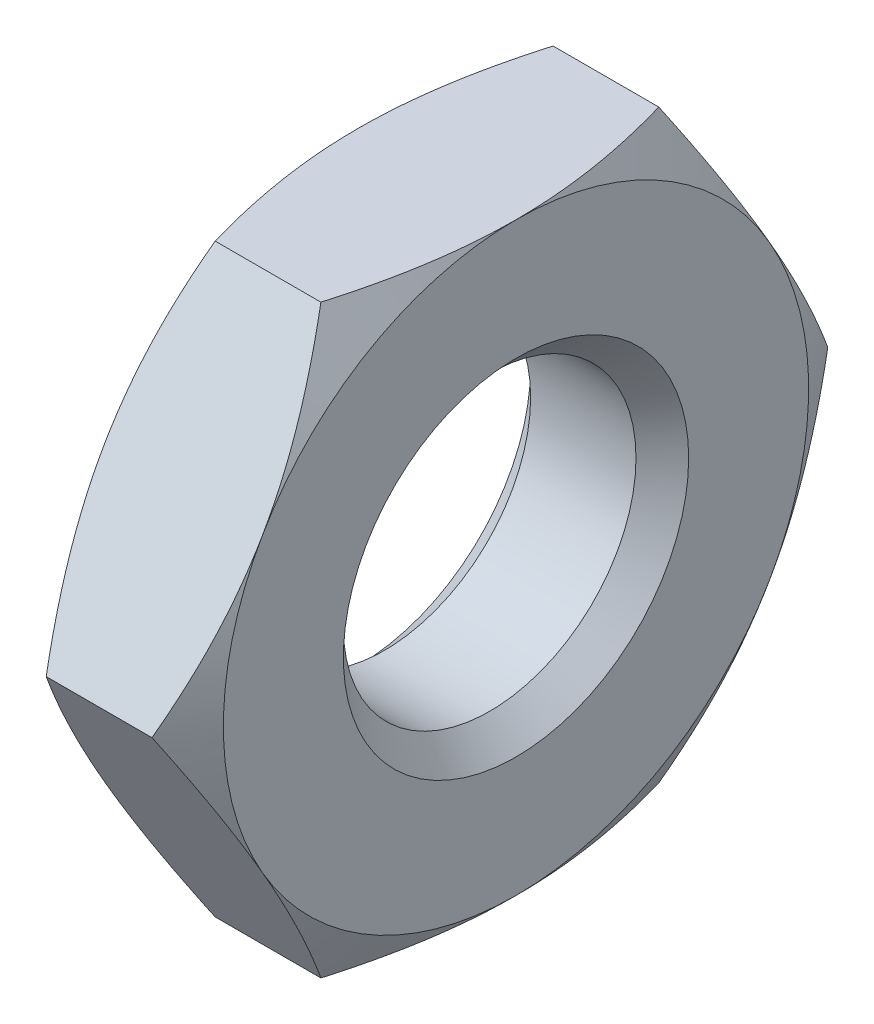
ISO-10303-21;
HEADER;
FILE_DESCRIPTION(('STEP AP214'),'2;1');
FILE_NAME('part.step','',(''),(''),'','','');
FILE_SCHEMA(('AUTOMOTIVE_DESIGN { 1 0 10303 214 1 1 1 1 }'));
ENDSEC;
DATA;
#1=APPLICATION_CONTEXT('core data for automotive mechanical design processes');
#2=APPLICATION_PROTOCOL_DEFINITION('international standard','automotive_design',2000,#1);
#3=PRODUCT_CONTEXT('',#1,'mechanical');
#4=PRODUCT('Part','Part','',(#3));
#5=PRODUCT_RELATED_PRODUCT_CATEGORY('part','',(#4));
#6=PRODUCT_DEFINITION_FORMATION('','',#4);
#7=PRODUCT_DEFINITION_CONTEXT('part definition',#1,'design');
#8=PRODUCT_DEFINITION('design','',#6,#7);
#9=PRODUCT_DEFINITION_SHAPE('','',#8);
#10=(LENGTH_UNIT() NAMED_UNIT(*) SI_UNIT(.MILLI.,.METRE.));
#11=(NAMED_UNIT(*) PLANE_ANGLE_UNIT() SI_UNIT($,.RADIAN.));
#12=(NAMED_UNIT(*) SI_UNIT($,.STERADIAN.) SOLID_ANGLE_UNIT());
#13=UNCERTAINTY_MEASURE_WITH_UNIT(LENGTH_MEASURE(1.E-05),#10,'distance_accuracy_value','');
#14=(GEOMETRIC_REPRESENTATION_CONTEXT(3) GLOBAL_UNCERTAINTY_ASSIGNED_CONTEXT((#13)) GLOBAL_UNIT_ASSIGNED_CONTEXT((#10,
#11,#12)) REPRESENTATION_CONTEXT('',''));
#15=CARTESIAN_POINT('',(0.,0.,0.));
#16=DIRECTION('',(0.,0.,1.));
#17=DIRECTION('',(1.,0.,0.));
#18=AXIS2_PLACEMENT_3D('',#15,#16,#17);
#19=CARTESIAN_POINT('',(1.35,2.5,-1.44337567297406));
#20=DIRECTION('',(1.,0.,0.));
#21=DIRECTION('',(0.,0.,-1.));
#22=AXIS2_PLACEMENT_3D('',#19,#20,#21);
#23=PLANE('',#22);
#24=CARTESIAN_POINT('',(1.35,0.,0.));
#25=DIRECTION('',(1.,0.,0.));
#26=DIRECTION('',(0.,0.,-1.));
#27=AXIS2_PLACEMENT_3D('',#24,#25,#26);
#28=CIRCLE('',#27,1.47500000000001);
#29=CARTESIAN_POINT('',(1.35,0.,-1.47500000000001));
#30=VERTEX_POINT('',#29);
#31=EDGE_CURVE('E11',#30,#30,#28,.F.);
#32=ORIENTED_EDGE('',*,*,#31,.T.);
#33=EDGE_LOOP('',(#32));
#34=FACE_BOUND('',#33,.T.);
#35=CARTESIAN_POINT('',(1.35,0.,0.));
#36=DIRECTION('',(1.,0.,0.));
#37=DIRECTION('',(0.,0.,-1.));
#38=AXIS2_PLACEMENT_3D('',#35,#36,#37);
#39=CIRCLE('',#38,2.5);
#40=CARTESIAN_POINT('',(1.35,-2.5,0.));
#41=VERTEX_POINT('',#40);
#42=CARTESIAN_POINT('',(1.35,-1.25,-2.1650635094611));
#43=VERTEX_POINT('',#42);
#44=EDGE_CURVE('E142',#41,#43,#39,.T.);
#45=ORIENTED_EDGE('',*,*,#44,.T.);
#46=CARTESIAN_POINT('',(1.35,1.25,-2.1650635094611));
#47=VERTEX_POINT('',#46);
#48=EDGE_CURVE('E130',#43,#47,#39,.T.);
#49=ORIENTED_EDGE('',*,*,#48,.T.);
#50=CARTESIAN_POINT('',(1.35,2.5,0.));
#51=VERTEX_POINT('',#50);
#52=EDGE_CURVE('E144',#47,#51,#39,.T.);
#53=ORIENTED_EDGE('',*,*,#52,.T.);
#54=CARTESIAN_POINT('',(1.35,1.25,2.1650635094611));
#55=VERTEX_POINT('',#54);
#56=EDGE_CURVE('E55',#51,#55,#39,.T.);
#57=ORIENTED_EDGE('',*,*,#56,.T.);
#58=CARTESIAN_POINT('',(1.35,-1.25,2.1650635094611));
#59=VERTEX_POINT('',#58);
#60=EDGE_CURVE('E63',#55,#59,#39,.T.);
#61=ORIENTED_EDGE('',*,*,#60,.T.);
#62=EDGE_CURVE('E166',#59,#41,#39,.T.);
#63=ORIENTED_EDGE('',*,*,#62,.T.);
#64=EDGE_LOOP('',(#45,#49,#53,#57,#61,#63));
#65=FACE_BOUND('',#64,.T.);
#66=ADVANCED_FACE('F39',(#34,#65),#23,.T.);
#67=CARTESIAN_POINT('',(0.,2.5,-1.44337567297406));
#68=DIRECTION('',(1.,0.,0.));
#69=DIRECTION('',(0.,0.,-1.));
#70=AXIS2_PLACEMENT_3D('',#67,#68,#69);
#71=PLANE('',#70);
#72=CARTESIAN_POINT('',(0.,0.,0.));
#73=DIRECTION('',(1.,0.,0.));
#74=DIRECTION('',(0.,0.,-1.));
#75=AXIS2_PLACEMENT_3D('',#72,#73,#74);
#76=CIRCLE('',#75,1.475);
#77=CARTESIAN_POINT('',(0.,0.,-1.475));
#78=VERTEX_POINT('',#77);
#79=EDGE_CURVE('E164',#78,#78,#76,.T.);
#80=ORIENTED_EDGE('',*,*,#79,.T.);
#81=EDGE_LOOP('',(#80));
#82=FACE_BOUND('',#81,.T.);
#83=CARTESIAN_POINT('',(0.,0.,0.));
#84=DIRECTION('',(1.,0.,0.));
#85=DIRECTION('',(0.,0.,-1.));
#86=AXIS2_PLACEMENT_3D('',#83,#84,#85);
#87=CIRCLE('',#86,2.5);
#88=CARTESIAN_POINT('',(0.,-1.25,-2.1650635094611));
#89=VERTEX_POINT('',#88);
#90=CARTESIAN_POINT('',(0.,1.25,-2.1650635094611));
#91=VERTEX_POINT('',#90);
#92=EDGE_CURVE('E173',#89,#91,#87,.T.);
#93=ORIENTED_EDGE('',*,*,#92,.F.);
#94=CARTESIAN_POINT('',(0.,-2.5,0.));
#95=VERTEX_POINT('',#94);
#96=EDGE_CURVE('E318',#95,#89,#87,.T.);
#97=ORIENTED_EDGE('',*,*,#96,.F.);
#98=CARTESIAN_POINT('',(0.,-1.25,2.1650635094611));
#99=VERTEX_POINT('',#98);
#100=EDGE_CURVE('E321',#99,#95,#87,.T.);
#101=ORIENTED_EDGE('',*,*,#100,.F.);
#102=CARTESIAN_POINT('',(0.,1.25,2.1650635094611));
#103=VERTEX_POINT('',#102);
#104=EDGE_CURVE('E327',#103,#99,#87,.T.);
#105=ORIENTED_EDGE('',*,*,#104,.F.);
#106=CARTESIAN_POINT('',(0.,2.5,0.));
#107=VERTEX_POINT('',#106);
#108=EDGE_CURVE('E178',#107,#103,#87,.T.);
#109=ORIENTED_EDGE('',*,*,#108,.F.);
#110=EDGE_CURVE('E174',#91,#107,#87,.T.);
#111=ORIENTED_EDGE('',*,*,#110,.F.);
#112=EDGE_LOOP('',(#93,#97,#101,#105,#109,#111));
#113=FACE_BOUND('',#112,.T.);
#114=ADVANCED_FACE('F319',(#82,#113),#71,.F.);
#115=CARTESIAN_POINT('',(1.35,0.,0.));
#116=DIRECTION('',(-1.,0.,0.));
#117=DIRECTION('',(0.,0.,1.));
#118=AXIS2_PLACEMENT_3D('',#115,#116,#117);
#119=CYLINDRICAL_SURFACE('',#118,1.25);
#120=CARTESIAN_POINT('',(0.224999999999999,0.,0.));
#121=DIRECTION('',(1.,0.,0.));
#122=DIRECTION('',(0.,0.,-1.));
#123=AXIS2_PLACEMENT_3D('',#120,#121,#122);
#124=CIRCLE('',#123,1.25);
#125=CARTESIAN_POINT('',(0.224999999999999,0.,1.25));
#126=VERTEX_POINT('',#125);
#127=EDGE_CURVE('E48',#126,#126,#124,.F.);
#128=CARTESIAN_POINT('',(1.125,0.,0.));
#129=DIRECTION('',(1.,0.,0.));
#130=DIRECTION('',(0.,0.,-1.));
#131=AXIS2_PLACEMENT_3D('',#128,#129,#130);
#132=CIRCLE('',#131,1.25);
#133=CARTESIAN_POINT('',(1.125,0.,1.25));
#134=VERTEX_POINT('',#133);
#135=EDGE_CURVE('E387',#134,#134,#132,.T.);
#136=CARTESIAN_POINT('',(0.224999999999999,0.,1.25));
#137=CARTESIAN_POINT('',(0.234374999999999,0.,1.25));
#138=CARTESIAN_POINT('',(0.243749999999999,0.,1.25));
#139=CARTESIAN_POINT('',(0.262499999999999,0.,1.25));
#140=CARTESIAN_POINT('',(0.271874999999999,0.,1.25));
#141=CARTESIAN_POINT('',(0.290624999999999,0.,1.25));
#142=CARTESIAN_POINT('',(0.299999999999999,0.,1.25));
#143=CARTESIAN_POINT('',(0.318749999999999,0.,1.25));
#144=CARTESIAN_POINT('',(0.328124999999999,0.,1.25));
#145=CARTESIAN_POINT('',(0.346874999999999,0.,1.25));
#146=CARTESIAN_POINT('',(0.356249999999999,0.,1.25));
#147=CARTESIAN_POINT('',(0.374999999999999,0.,1.25));
#148=CARTESIAN_POINT('',(0.384374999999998,0.,1.25));
#149=CARTESIAN_POINT('',(0.403124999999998,0.,1.25));
#150=CARTESIAN_POINT('',(0.412499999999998,0.,1.25));
#151=CARTESIAN_POINT('',(0.431249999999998,0.,1.25));
#152=CARTESIAN_POINT('',(0.440624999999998,0.,1.25));
#153=CARTESIAN_POINT('',(0.459374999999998,0.,1.25));
#154=CARTESIAN_POINT('',(0.468749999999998,0.,1.25));
#155=CARTESIAN_POINT('',(0.487499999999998,0.,1.25));
#156=CARTESIAN_POINT('',(0.496874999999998,0.,1.25));
#157=CARTESIAN_POINT('',(0.515624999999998,0.,1.25));
#158=CARTESIAN_POINT('',(0.524999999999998,0.,1.25));
#159=CARTESIAN_POINT('',(0.543749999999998,0.,1.25));
#160=CARTESIAN_POINT('',(0.553124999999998,0.,1.25));
#161=CARTESIAN_POINT('',(0.571874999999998,0.,1.25));
#162=CARTESIAN_POINT('',(0.581249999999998,0.,1.25));
#163=CARTESIAN_POINT('',(0.599999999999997,0.,1.25));
#164=CARTESIAN_POINT('',(0.609374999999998,0.,1.25));
#165=CARTESIAN_POINT('',(0.628124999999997,0.,1.25));
#166=CARTESIAN_POINT('',(0.637499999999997,0.,1.25));
#167=CARTESIAN_POINT('',(0.656249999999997,0.,1.25));
#168=CARTESIAN_POINT('',(0.665624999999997,0.,1.25));
#169=CARTESIAN_POINT('',(0.684374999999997,0.,1.25));
#170=CARTESIAN_POINT('',(0.693749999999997,0.,1.25));
#171=CARTESIAN_POINT('',(0.712499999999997,0.,1.25));
#172=CARTESIAN_POINT('',(0.721874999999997,0.,1.25));
#173=CARTESIAN_POINT('',(0.740624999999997,0.,1.25));
#174=CARTESIAN_POINT('',(0.749999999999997,0.,1.25));
#175=CARTESIAN_POINT('',(0.768749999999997,0.,1.25));
#176=CARTESIAN_POINT('',(0.778124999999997,0.,1.25));
#177=CARTESIAN_POINT('',(0.796874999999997,0.,1.25));
#178=CARTESIAN_POINT('',(0.806249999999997,0.,1.25));
#179=CARTESIAN_POINT('',(0.824999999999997,0.,1.25));
#180=CARTESIAN_POINT('',(0.834374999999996,0.,1.25));
#181=CARTESIAN_POINT('',(0.853124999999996,0.,1.25));
#182=CARTESIAN_POINT('',(0.862499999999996,0.,1.25));
#183=CARTESIAN_POINT('',(0.881249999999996,0.,1.25));
#184=CARTESIAN_POINT('',(0.890624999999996,0.,1.25));
#185=CARTESIAN_POINT('',(0.909374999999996,0.,1.25));
#186=CARTESIAN_POINT('',(0.918749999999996,0.,1.25));
#187=CARTESIAN_POINT('',(0.937499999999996,0.,1.25));
#188=CARTESIAN_POINT('',(0.946874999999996,0.,1.25));
#189=CARTESIAN_POINT('',(0.965624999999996,0.,1.25));
#190=CARTESIAN_POINT('',(0.974999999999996,0.,1.25));
#191=CARTESIAN_POINT('',(0.993749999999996,0.,1.25));
#192=CARTESIAN_POINT('',(1.003125,0.,1.25));
#193=CARTESIAN_POINT('',(1.021875,0.,1.25));
#194=CARTESIAN_POINT('',(1.03125,0.,1.25));
#195=CARTESIAN_POINT('',(1.05,0.,1.25));
#196=CARTESIAN_POINT('',(1.059375,0.,1.25));
#197=CARTESIAN_POINT('',(1.078125,0.,1.25));
#198=CARTESIAN_POINT('',(1.0875,0.,1.25));
#199=CARTESIAN_POINT('',(1.10625,0.,1.25));
#200=CARTESIAN_POINT('',(1.115625,0.,1.25));
#201=CARTESIAN_POINT('',(1.125,0.,1.25));
#202=B_SPLINE_CURVE_WITH_KNOTS('',3,(#136,#137,#138,#139,#140,#141,#142,#143,#144,#145,#146,
#147,#148,#149,#150,#151,#152,#153,#154,#155,#156,#157,#158,#159,#160,#161,#162,#163,#164,#165,
#166,#167,#168,#169,#170,#171,#172,#173,#174,#175,#176,#177,#178,#179,#180,#181,#182,#183,#184,
#185,#186,#187,#188,#189,#190,#191,#192,#193,#194,#195,#196,#197,#198,#199,#200,#201),
.UNSPECIFIED.,.F.,.F.,(4,2,2,2,2,2,2,2,2,2,2,2,2,2,2,2,2,2,2,2,2,2,2,2,2,2,2,2,2,2,2,2,4),(0.,
0.0281249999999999,0.0562499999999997,0.0843749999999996,0.1125,0.140624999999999,
0.168749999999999,0.196874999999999,0.224999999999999,0.253124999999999,0.281249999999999,
0.309374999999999,0.337499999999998,0.365624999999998,0.393749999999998,0.421874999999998,
0.449999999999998,0.478124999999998,0.506249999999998,0.534374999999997,0.562499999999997,
0.590624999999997,0.618749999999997,0.646874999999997,0.674999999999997,0.703124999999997,
0.731249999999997,0.759374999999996,0.787499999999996,0.815624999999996,0.843749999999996,
0.871874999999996,0.899999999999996),.UNSPECIFIED.);
#203=EDGE_CURVE('BSEAM233',#126,#134,#202,.T.);
#204=ORIENTED_EDGE('',*,*,#127,.T.);
#205=ORIENTED_EDGE('',*,*,#135,.T.);
#206=ORIENTED_EDGE('',*,*,#203,.T.);
#207=ORIENTED_EDGE('',*,*,#203,.F.);
#208=EDGE_LOOP('',(#204,#206,#205,#207));
#209=FACE_BOUND('',#208,.T.);
#210=ADVANCED_FACE('F233',(#209),#119,.F.);
#211=CARTESIAN_POINT('',(0.,0.,0.));
#212=DIRECTION('',(1.,0.,0.));
#213=DIRECTION('',(0.,0.,-1.));
#214=AXIS2_PLACEMENT_3D('',#211,#212,#213);
#215=CONICAL_SURFACE('',#214,2.5,1.0471975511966);
#216=CARTESIAN_POINT('',(0.223357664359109,-2.5002,-1.44326020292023));
#217=CARTESIAN_POINT('',(0.186721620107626,-2.39033676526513,-1.50668977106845));
#218=CARTESIAN_POINT('',(0.153402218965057,-2.27952520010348,-1.57066685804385));
#219=CARTESIAN_POINT('',(0.0952422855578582,-2.05598316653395,-1.69972891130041));
#220=CARTESIAN_POINT('',(0.0704223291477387,-1.94324872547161,-1.7648161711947));
#221=CARTESIAN_POINT('',(0.0317856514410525,-1.71917700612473,-1.8941840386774));
#222=CARTESIAN_POINT('',(0.0177117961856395,-1.60787420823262,-1.95844473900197));
#223=CARTESIAN_POINT('',(0.000909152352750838,-1.38474477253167,-2.08726857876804));
#224=CARTESIAN_POINT('',(-0.00183354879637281,-1.27291894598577,-2.15183124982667));
#225=CARTESIAN_POINT('',(0.0038657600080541,-1.06395802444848,-2.27247489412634));
#226=CARTESIAN_POINT('',(0.0109083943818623,-0.966791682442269,-2.32857390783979));
#227=CARTESIAN_POINT('',(0.033231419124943,-0.773092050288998,-2.44040644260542));
#228=CARTESIAN_POINT('',(0.0485194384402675,-0.676559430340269,-2.4961395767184));
#229=CARTESIAN_POINT('',(0.0867390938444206,-0.482460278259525,-2.60820277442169));
#230=CARTESIAN_POINT('',(0.109832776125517,-0.384918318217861,-2.66451865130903));
#231=CARTESIAN_POINT('',(0.162246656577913,-0.191289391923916,-2.77631036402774));
#232=CARTESIAN_POINT('',(0.191554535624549,-0.0951999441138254,-2.83178763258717));
#233=CARTESIAN_POINT('',(0.223357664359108,0.000199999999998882,-2.88686681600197));
#234=B_SPLINE_CURVE_WITH_KNOTS('',3,(#216,#217,#218,#219,#220,#221,#222,#223,#224,#225,#226,
#227,#228,#229,#230,#231,#232,#233),.UNSPECIFIED.,.F.,.F.,(4,2,2,2,2,2,2,2,4),(0.,
0.396285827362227,0.793524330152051,1.18093086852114,1.56786160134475,1.90479741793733,
2.24204551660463,2.58677531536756,2.93082800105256),.UNSPECIFIED.);
#235=CARTESIAN_POINT('',(0.223290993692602,0.,-2.88675134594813));
#236=VERTEX_POINT('',#235);
#237=EDGE_CURVE('E334',#89,#236,#234,.T.);
#238=ORIENTED_EDGE('',*,*,#237,.F.);
#239=ORIENTED_EDGE('',*,*,#92,.T.);
#240=CARTESIAN_POINT('',(0.223357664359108,-0.000200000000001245,-2.88686681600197));
#241=CARTESIAN_POINT('',(0.186721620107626,0.10966323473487,-2.82343724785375));
#242=CARTESIAN_POINT('',(0.153402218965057,0.220474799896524,-2.75946016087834));
#243=CARTESIAN_POINT('',(0.095242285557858,0.444016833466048,-2.63039810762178));
#244=CARTESIAN_POINT('',(0.0704223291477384,0.556751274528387,-2.5653108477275));
#245=CARTESIAN_POINT('',(0.0317856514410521,0.780822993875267,-2.43594298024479));
#246=CARTESIAN_POINT('',(0.0177117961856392,0.892125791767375,-2.37168227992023));
#247=CARTESIAN_POINT('',(0.000909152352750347,1.11525522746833,-2.24285844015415));
#248=CARTESIAN_POINT('',(-0.0018335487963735,1.22708105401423,-2.17829576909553));
#249=CARTESIAN_POINT('',(0.0038657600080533,1.43604197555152,-2.05765212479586));
#250=CARTESIAN_POINT('',(0.0109083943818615,1.53320831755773,-2.0015531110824));
#251=CARTESIAN_POINT('',(0.0332314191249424,1.726907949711,-1.88972057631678));
#252=CARTESIAN_POINT('',(0.0485194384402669,1.82344056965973,-1.8339874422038));
#253=CARTESIAN_POINT('',(0.0867390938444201,2.01753972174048,-1.7219242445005));
#254=CARTESIAN_POINT('',(0.109832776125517,2.11508168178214,-1.66560836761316));
#255=CARTESIAN_POINT('',(0.162246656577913,2.30871060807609,-1.55381665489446));
#256=CARTESIAN_POINT('',(0.191554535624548,2.40480005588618,-1.49833938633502));
#257=CARTESIAN_POINT('',(0.223357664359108,2.5002,-1.44326020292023));
#258=B_SPLINE_CURVE_WITH_KNOTS('',3,(#240,#241,#242,#243,#244,#245,#246,#247,#248,#249,#250,
#251,#252,#253,#254,#255,#256,#257),.UNSPECIFIED.,.F.,.F.,(4,2,2,2,2,2,2,2,4),(0.,
0.396285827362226,0.793524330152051,1.18093086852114,1.56786160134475,1.90479741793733,
2.24204551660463,2.58677531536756,2.93082800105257),.UNSPECIFIED.);
#259=EDGE_CURVE('E214',#236,#91,#258,.T.);
#260=ORIENTED_EDGE('',*,*,#259,.F.);
#261=EDGE_LOOP('',(#238,#239,#260));
#262=FACE_BOUND('',#261,.T.);
#263=ADVANCED_FACE('F194',(#262),#215,.T.);
#264=ORIENTED_EDGE('',*,*,#96,.T.);
#265=CARTESIAN_POINT('',(0.223290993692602,-2.5,-1.44337567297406));
#266=VERTEX_POINT('',#265);
#267=EDGE_CURVE('E156',#266,#89,#234,.T.);
#268=ORIENTED_EDGE('',*,*,#267,.F.);
#269=CARTESIAN_POINT('',(1.22684899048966,-2.5,-3.89105374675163));
#270=CARTESIAN_POINT('',(1.17376935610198,-2.5,-3.78174691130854));
#271=CARTESIAN_POINT('',(1.12119463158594,-2.5,-3.67219065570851));
#272=CARTESIAN_POINT('',(1.01733868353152,-2.5,-3.45244672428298));
#273=CARTESIAN_POINT('',(0.966057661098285,-2.5,-3.34225895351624));
#274=CARTESIAN_POINT('',(0.864817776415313,-2.5,-3.12055834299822));
#275=CARTESIAN_POINT('',(0.814867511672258,-2.5,-3.00904156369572));
#276=CARTESIAN_POINT('',(0.716992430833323,-2.5,-2.7851259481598));
#277=CARTESIAN_POINT('',(0.669067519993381,-2.5,-2.67272715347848));
#278=CARTESIAN_POINT('',(0.574254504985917,-2.5,-2.44318186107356));
#279=CARTESIAN_POINT('',(0.527451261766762,-2.5,-2.32600012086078));
#280=CARTESIAN_POINT('',(0.437353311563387,-2.5,-2.09027081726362));
#281=CARTESIAN_POINT('',(0.39405899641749,-2.5,-1.97172310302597));
#282=CARTESIAN_POINT('',(0.312105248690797,-2.5,-1.73329071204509));
#283=CARTESIAN_POINT('',(0.273436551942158,-2.5,-1.61340925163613));
#284=CARTESIAN_POINT('',(0.201965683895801,-2.5,-1.37192659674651));
#285=CARTESIAN_POINT('',(0.169161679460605,-2.5,-1.25032595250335));
#286=CARTESIAN_POINT('',(0.111161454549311,-2.5,-1.00601685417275));
#287=CARTESIAN_POINT('',(0.0859232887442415,-2.5,-0.883318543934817));
#288=CARTESIAN_POINT('',(0.0444701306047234,-2.5,-0.636381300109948));
#289=CARTESIAN_POINT('',(0.0282542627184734,-2.5,-0.512142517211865));
#290=CARTESIAN_POINT('',(0.0063510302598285,-2.5,-0.264373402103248));
#291=CARTESIAN_POINT('',(0.000527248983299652,-2.5,-0.140855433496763));
#292=CARTESIAN_POINT('',(-0.000458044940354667,-2.5,0.106233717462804));
#293=CARTESIAN_POINT('',(0.0043806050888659,-2.5,0.229804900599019));
#294=CARTESIAN_POINT('',(0.0212689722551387,-2.5,0.439180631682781));
#295=CARTESIAN_POINT('',(0.0307237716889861,-2.5,0.525207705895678));
#296=CARTESIAN_POINT('',(0.0542196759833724,-2.5,0.696639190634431));
#297=CARTESIAN_POINT('',(0.0682613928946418,-2.5,0.782043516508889));
#298=CARTESIAN_POINT('',(0.116531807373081,-2.5,1.0371936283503));
#299=CARTESIAN_POINT('',(0.156897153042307,-2.5,1.20578228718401));
#300=CARTESIAN_POINT('',(0.250636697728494,-2.5,1.543210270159));
#301=CARTESIAN_POINT('',(0.304280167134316,-2.5,1.71197183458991));
#302=CARTESIAN_POINT('',(0.391294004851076,-2.5,1.96276872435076));
#303=CARTESIAN_POINT('',(0.421386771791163,-2.5,2.04596870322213));
#304=CARTESIAN_POINT('',(0.483412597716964,-2.5,2.2116797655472));
#305=CARTESIAN_POINT('',(0.515345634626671,-2.5,2.29419085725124));
#306=CARTESIAN_POINT('',(0.593055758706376,-2.5,2.48955705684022));
#307=CARTESIAN_POINT('',(0.63951800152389,-2.5,2.60213884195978));
#308=CARTESIAN_POINT('',(0.734728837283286,-2.5,2.8263339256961));
#309=CARTESIAN_POINT('',(0.783477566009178,-2.5,2.9379471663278));
#310=CARTESIAN_POINT('',(0.93244011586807,-2.5,3.27162573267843));
#311=CARTESIAN_POINT('',(1.03535190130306,-2.5,3.49248482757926));
#312=CARTESIAN_POINT('',(1.24592945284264,-2.5,3.93218255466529));
#313=CARTESIAN_POINT('',(1.35360006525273,-2.5,4.15101883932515));
#314=CARTESIAN_POINT('',(1.57212757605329,-2.5,4.58710086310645));
#315=CARTESIAN_POINT('',(1.68298459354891,-2.5,4.80434654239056));
#316=CARTESIAN_POINT('',(1.89746112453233,-2.5,5.21932476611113));
#317=CARTESIAN_POINT('',(2.00089851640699,-2.5,5.41715177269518));
#318=CARTESIAN_POINT('',(2.20918900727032,-2.5,5.81206751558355));
#319=CARTESIAN_POINT('',(2.3140421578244,-2.5,6.00915622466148));
#320=CARTESIAN_POINT('',(2.52455741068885,-2.5,6.40225546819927));
#321=CARTESIAN_POINT('',(2.63021677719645,-2.5,6.59826746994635));
#322=CARTESIAN_POINT('',(2.8423801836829,-2.5,6.98981967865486));
#323=CARTESIAN_POINT('',(2.94888417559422,-2.5,7.18535991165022));
#324=CARTESIAN_POINT('',(3.05570303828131,-2.5,7.38072677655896));
#325=B_SPLINE_CURVE_WITH_KNOTS('',3,(#269,#270,#271,#272,#273,#274,#275,#276,#277,#278,#279,
#280,#281,#282,#283,#284,#285,#286,#287,#288,#289,#290,#291,#292,#293,#294,#295,#296,#297,#298,
#299,#300,#301,#302,#303,#304,#305,#306,#307,#308,#309,#310,#311,#312,#313,#314,#315,#316,#317,
#318,#319,#320,#321,#322,#323,#324),.UNSPECIFIED.,.F.,.F.,(4,2,2,2,2,2,2,2,2,2,2,2,2,2,2,2,2,2,
2,2,2,2,2,2,2,2,2,4),(0.,0.364543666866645,0.729143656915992,1.09570519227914,1.46224956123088,
1.8407545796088,2.21930180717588,2.59707771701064,2.97473533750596,3.35025874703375,
3.7257457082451,4.09626635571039,4.46679265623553,4.72630326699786,4.98584851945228,
5.50522166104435,6.03614190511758,6.3015497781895,6.56695446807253,6.9322983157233,
7.29766388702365,8.02854100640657,8.76018040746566,9.49184719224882,10.1615519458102,
10.831281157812,11.4993069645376,12.1672950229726),.UNSPECIFIED.);
#326=EDGE_CURVE('E177',#95,#266,#325,.F.);
#327=ORIENTED_EDGE('',*,*,#326,.F.);
#328=EDGE_LOOP('',(#264,#268,#327));
#329=FACE_BOUND('',#328,.T.);
#330=ADVANCED_FACE('F351',(#329),#215,.T.);
#331=CARTESIAN_POINT('',(0.675,0.,0.));
#332=DIRECTION('',(-1.,0.,0.));
#333=DIRECTION('',(0.,0.,1.));
#334=AXIS2_PLACEMENT_3D('',#331,#332,#333);
#335=CONICAL_SURFACE('',#334,3.669134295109,1.0471975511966);
#336=CARTESIAN_POINT('',(1.12664233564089,0.000199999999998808,-2.88686681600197));
#337=CARTESIAN_POINT('',(1.16327837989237,-0.109663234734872,-2.82343724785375));
#338=CARTESIAN_POINT('',(1.19659778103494,-0.220474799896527,-2.75946016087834));
#339=CARTESIAN_POINT('',(1.25475771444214,-0.444016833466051,-2.63039810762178));
#340=CARTESIAN_POINT('',(1.27957767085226,-0.55675127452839,-2.5653108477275));
#341=CARTESIAN_POINT('',(1.31821434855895,-0.78082299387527,-2.43594298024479));
#342=CARTESIAN_POINT('',(1.33228820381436,-0.892125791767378,-2.37168227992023));
#343=CARTESIAN_POINT('',(1.34909084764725,-1.11525522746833,-2.24285844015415));
#344=CARTESIAN_POINT('',(1.35183354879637,-1.22708105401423,-2.17829576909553));
#345=CARTESIAN_POINT('',(1.34613423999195,-1.43604197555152,-2.05765212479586));
#346=CARTESIAN_POINT('',(1.33909160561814,-1.53320831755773,-2.0015531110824));
#347=CARTESIAN_POINT('',(1.31676858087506,-1.726907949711,-1.88972057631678));
#348=CARTESIAN_POINT('',(1.30148056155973,-1.82344056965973,-1.8339874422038));
#349=CARTESIAN_POINT('',(1.26326090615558,-2.01753972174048,-1.7219242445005));
#350=CARTESIAN_POINT('',(1.24016722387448,-2.11508168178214,-1.66560836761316));
#351=CARTESIAN_POINT('',(1.18775334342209,-2.30871060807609,-1.55381665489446));
#352=CARTESIAN_POINT('',(1.15844546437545,-2.40480005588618,-1.49833938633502));
#353=CARTESIAN_POINT('',(1.12664233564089,-2.5002,-1.44326020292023));
#354=B_SPLINE_CURVE_WITH_KNOTS('',3,(#336,#337,#338,#339,#340,#341,#342,#343,#344,#345,#346,
#347,#348,#349,#350,#351,#352,#353),.UNSPECIFIED.,.F.,.F.,(4,2,2,2,2,2,2,2,4),(0.,
0.396285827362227,0.793524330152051,1.18093086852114,1.56786160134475,1.90479741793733,
2.24204551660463,2.58677531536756,2.93082800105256),.UNSPECIFIED.);
#355=CARTESIAN_POINT('',(1.1267090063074,-2.5,-1.44337567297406));
#356=VERTEX_POINT('',#355);
#357=EDGE_CURVE('E147',#43,#356,#354,.T.);
#358=ORIENTED_EDGE('',*,*,#357,.F.);
#359=ORIENTED_EDGE('',*,*,#44,.F.);
#360=CARTESIAN_POINT('',(0.123151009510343,-2.5,-3.89105374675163));
#361=CARTESIAN_POINT('',(0.176230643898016,-2.5,-3.78174691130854));
#362=CARTESIAN_POINT('',(0.228805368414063,-2.5,-3.67219065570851));
#363=CARTESIAN_POINT('',(0.33266131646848,-2.5,-3.45244672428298));
#364=CARTESIAN_POINT('',(0.383942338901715,-2.5,-3.34225895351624));
#365=CARTESIAN_POINT('',(0.485182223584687,-2.5,-3.12055834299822));
#366=CARTESIAN_POINT('',(0.535132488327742,-2.5,-3.00904156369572));
#367=CARTESIAN_POINT('',(0.633007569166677,-2.5,-2.7851259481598));
#368=CARTESIAN_POINT('',(0.680932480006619,-2.5,-2.67272715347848));
#369=CARTESIAN_POINT('',(0.775745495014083,-2.5,-2.44318186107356));
#370=CARTESIAN_POINT('',(0.822548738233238,-2.5,-2.32600012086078));
#371=CARTESIAN_POINT('',(0.912646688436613,-2.5,-2.09027081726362));
#372=CARTESIAN_POINT('',(0.95594100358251,-2.5,-1.97172310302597));
#373=CARTESIAN_POINT('',(1.0378947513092,-2.5,-1.73329071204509));
#374=CARTESIAN_POINT('',(1.07656344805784,-2.5,-1.61340925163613));
#375=CARTESIAN_POINT('',(1.1480343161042,-2.5,-1.3719265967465));
#376=CARTESIAN_POINT('',(1.18083832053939,-2.5,-1.25032595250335));
#377=CARTESIAN_POINT('',(1.23883854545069,-2.5,-1.00601685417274));
#378=CARTESIAN_POINT('',(1.26407671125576,-2.5,-0.883318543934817));
#379=CARTESIAN_POINT('',(1.30552986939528,-2.5,-0.636381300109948));
#380=CARTESIAN_POINT('',(1.32174573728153,-2.5,-0.512142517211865));
#381=CARTESIAN_POINT('',(1.34364896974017,-2.5,-0.264373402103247));
#382=CARTESIAN_POINT('',(1.3494727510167,-2.5,-0.140855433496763));
#383=CARTESIAN_POINT('',(1.35045804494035,-2.5,0.106233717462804));
#384=CARTESIAN_POINT('',(1.34561939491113,-2.5,0.22980490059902));
#385=CARTESIAN_POINT('',(1.32873102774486,-2.5,0.439180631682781));
#386=CARTESIAN_POINT('',(1.31927622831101,-2.5,0.525207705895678));
#387=CARTESIAN_POINT('',(1.29578032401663,-2.5,0.696639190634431));
#388=CARTESIAN_POINT('',(1.28173860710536,-2.5,0.782043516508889));
#389=CARTESIAN_POINT('',(1.23346819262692,-2.5,1.0371936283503));
#390=CARTESIAN_POINT('',(1.19310284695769,-2.5,1.20578228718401));
#391=CARTESIAN_POINT('',(1.09936330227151,-2.5,1.543210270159));
#392=CARTESIAN_POINT('',(1.04571983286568,-2.5,1.71197183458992));
#393=CARTESIAN_POINT('',(0.958705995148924,-2.5,1.96276872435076));
#394=CARTESIAN_POINT('',(0.928613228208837,-2.5,2.04596870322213));
#395=CARTESIAN_POINT('',(0.866587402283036,-2.5,2.2116797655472));
#396=CARTESIAN_POINT('',(0.834654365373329,-2.5,2.29419085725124));
#397=CARTESIAN_POINT('',(0.756944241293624,-2.5,2.48955705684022));
#398=CARTESIAN_POINT('',(0.71048199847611,-2.5,2.60213884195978));
#399=CARTESIAN_POINT('',(0.615271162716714,-2.5,2.8263339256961));
#400=CARTESIAN_POINT('',(0.566522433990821,-2.5,2.93794716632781));
#401=CARTESIAN_POINT('',(0.41755988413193,-2.5,3.27162573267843));
#402=CARTESIAN_POINT('',(0.314648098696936,-2.5,3.49248482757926));
#403=CARTESIAN_POINT('',(0.104070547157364,-2.5,3.93218255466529));
#404=CARTESIAN_POINT('',(-0.00360006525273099,-2.5,4.15101883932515));
#405=CARTESIAN_POINT('',(-0.222127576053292,-2.5,4.58710086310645));
#406=CARTESIAN_POINT('',(-0.332984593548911,-2.5,4.80434654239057));
#407=CARTESIAN_POINT('',(-0.547461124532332,-2.5,5.21932476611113));
#408=CARTESIAN_POINT('',(-0.650898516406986,-2.5,5.41715177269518));
#409=CARTESIAN_POINT('',(-0.85918900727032,-2.5,5.81206751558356));
#410=CARTESIAN_POINT('',(-0.964042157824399,-2.5,6.00915622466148));
#411=CARTESIAN_POINT('',(-1.17455741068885,-2.5,6.40225546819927));
#412=CARTESIAN_POINT('',(-1.28021677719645,-2.5,6.59826746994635));
#413=CARTESIAN_POINT('',(-1.4923801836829,-2.5,6.98981967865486));
#414=CARTESIAN_POINT('',(-1.59888417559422,-2.5,7.18535991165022));
#415=CARTESIAN_POINT('',(-1.70570303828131,-2.5,7.38072677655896));
#416=B_SPLINE_CURVE_WITH_KNOTS('',3,(#360,#361,#362,#363,#364,#365,#366,#367,#368,#369,#370,
#371,#372,#373,#374,#375,#376,#377,#378,#379,#380,#381,#382,#383,#384,#385,#386,#387,#388,#389,
#390,#391,#392,#393,#394,#395,#396,#397,#398,#399,#400,#401,#402,#403,#404,#405,#406,#407,#408,
#409,#410,#411,#412,#413,#414,#415),.UNSPECIFIED.,.F.,.F.,(4,2,2,2,2,2,2,2,2,2,2,2,2,2,2,2,2,2,
2,2,2,2,2,2,2,2,2,4),(0.,0.364543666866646,0.729143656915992,1.09570519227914,1.46224956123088,
1.8407545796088,2.21930180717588,2.59707771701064,2.97473533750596,3.35025874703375,
3.7257457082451,4.09626635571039,4.46679265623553,4.72630326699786,4.98584851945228,
5.50522166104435,6.03614190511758,6.3015497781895,6.56695446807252,6.9322983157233,
7.29766388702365,8.02854100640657,8.76018040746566,9.49184719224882,10.1615519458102,
10.831281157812,11.4993069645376,12.1672950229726),.UNSPECIFIED.);
#417=EDGE_CURVE('E151',#356,#41,#416,.T.);
#418=ORIENTED_EDGE('',*,*,#417,.F.);
#419=EDGE_LOOP('',(#358,#359,#418));
#420=FACE_BOUND('',#419,.T.);
#421=ADVANCED_FACE('F148',(#420),#335,.T.);
#422=ORIENTED_EDGE('',*,*,#48,.F.);
#423=CARTESIAN_POINT('',(1.1267090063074,0.,-2.88675134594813));
#424=VERTEX_POINT('',#423);
#425=EDGE_CURVE('E134',#424,#43,#354,.T.);
#426=ORIENTED_EDGE('',*,*,#425,.F.);
#427=CARTESIAN_POINT('',(1.12664233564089,2.5002,-1.44326020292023));
#428=CARTESIAN_POINT('',(1.16327837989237,2.39033676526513,-1.50668977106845));
#429=CARTESIAN_POINT('',(1.19659778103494,2.27952520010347,-1.57066685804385));
#430=CARTESIAN_POINT('',(1.25475771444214,2.05598316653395,-1.69972891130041));
#431=CARTESIAN_POINT('',(1.27957767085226,1.94324872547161,-1.7648161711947));
#432=CARTESIAN_POINT('',(1.31821434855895,1.71917700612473,-1.8941840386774));
#433=CARTESIAN_POINT('',(1.33228820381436,1.60787420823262,-1.95844473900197));
#434=CARTESIAN_POINT('',(1.34909084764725,1.38474477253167,-2.08726857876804));
#435=CARTESIAN_POINT('',(1.35183354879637,1.27291894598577,-2.15183124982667));
#436=CARTESIAN_POINT('',(1.34613423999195,1.06395802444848,-2.27247489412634));
#437=CARTESIAN_POINT('',(1.33909160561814,0.966791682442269,-2.32857390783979));
#438=CARTESIAN_POINT('',(1.31676858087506,0.773092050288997,-2.44040644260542));
#439=CARTESIAN_POINT('',(1.30148056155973,0.676559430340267,-2.49613957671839));
#440=CARTESIAN_POINT('',(1.26326090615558,0.482460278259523,-2.60820277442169));
#441=CARTESIAN_POINT('',(1.24016722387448,0.384918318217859,-2.66451865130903));
#442=CARTESIAN_POINT('',(1.18775334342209,0.191289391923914,-2.77631036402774));
#443=CARTESIAN_POINT('',(1.15844546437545,0.0951999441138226,-2.83178763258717));
#444=CARTESIAN_POINT('',(1.12664233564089,-0.000200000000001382,-2.88686681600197));
#445=B_SPLINE_CURVE_WITH_KNOTS('',3,(#427,#428,#429,#430,#431,#432,#433,#434,#435,#436,#437,
#438,#439,#440,#441,#442,#443,#444),.UNSPECIFIED.,.F.,.F.,(4,2,2,2,2,2,2,2,4),(0.,
0.396285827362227,0.793524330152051,1.18093086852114,1.56786160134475,1.90479741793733,
2.24204551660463,2.58677531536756,2.93082800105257),.UNSPECIFIED.);
#446=EDGE_CURVE('E136',#47,#424,#445,.T.);
#447=ORIENTED_EDGE('',*,*,#446,.F.);
#448=EDGE_LOOP('',(#422,#426,#447));
#449=FACE_BOUND('',#448,.T.);
#450=ADVANCED_FACE('F132',(#449),#335,.T.);
#451=ORIENTED_EDGE('',*,*,#100,.T.);
#452=CARTESIAN_POINT('',(0.223290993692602,-2.5,1.44337567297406));
#453=VERTEX_POINT('',#452);
#454=EDGE_CURVE('E187',#453,#95,#325,.F.);
#455=ORIENTED_EDGE('',*,*,#454,.F.);
#456=CARTESIAN_POINT('',(0.223357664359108,0.00020000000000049,2.88686681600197));
#457=CARTESIAN_POINT('',(0.186721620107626,-0.109663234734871,2.82343724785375));
#458=CARTESIAN_POINT('',(0.153402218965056,-0.220474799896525,2.75946016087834));
#459=CARTESIAN_POINT('',(0.0952422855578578,-0.444016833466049,2.63039810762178));
#460=CARTESIAN_POINT('',(0.0704223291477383,-0.556751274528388,2.5653108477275));
#461=CARTESIAN_POINT('',(0.0317856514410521,-0.780822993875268,2.43594298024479));
#462=CARTESIAN_POINT('',(0.0177117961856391,-0.892125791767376,2.37168227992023));
#463=CARTESIAN_POINT('',(0.000909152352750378,-1.11525522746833,2.24285844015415));
#464=CARTESIAN_POINT('',(-0.00183354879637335,-1.22708105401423,2.17829576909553));
#465=CARTESIAN_POINT('',(0.00386576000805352,-1.43604197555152,2.05765212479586));
#466=CARTESIAN_POINT('',(0.0109083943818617,-1.53320831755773,2.0015531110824));
#467=CARTESIAN_POINT('',(0.0332314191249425,-1.726907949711,1.88972057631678));
#468=CARTESIAN_POINT('',(0.048519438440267,-1.82344056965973,1.8339874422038));
#469=CARTESIAN_POINT('',(0.0867390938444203,-2.01753972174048,1.7219242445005));
#470=CARTESIAN_POINT('',(0.109832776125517,-2.11508168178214,1.66560836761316));
#471=CARTESIAN_POINT('',(0.162246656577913,-2.30871060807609,1.55381665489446));
#472=CARTESIAN_POINT('',(0.191554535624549,-2.40480005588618,1.49833938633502));
#473=CARTESIAN_POINT('',(0.223357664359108,-2.5002,1.44326020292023));
#474=B_SPLINE_CURVE_WITH_KNOTS('',3,(#456,#457,#458,#459,#460,#461,#462,#463,#464,#465,#466,
#467,#468,#469,#470,#471,#472,#473),.UNSPECIFIED.,.F.,.F.,(4,2,2,2,2,2,2,2,4),(0.,
0.396285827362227,0.793524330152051,1.18093086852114,1.56786160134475,1.90479741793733,
2.24204551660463,2.58677531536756,2.93082800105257),.UNSPECIFIED.);
#475=EDGE_CURVE('E188',#99,#453,#474,.T.);
#476=ORIENTED_EDGE('',*,*,#475,.F.);
#477=EDGE_LOOP('',(#451,#455,#476));
#478=FACE_BOUND('',#477,.T.);
#479=ADVANCED_FACE('F350',(#478),#215,.T.);
#480=CARTESIAN_POINT('',(1.1267090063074,-2.5,1.44337567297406));
#481=VERTEX_POINT('',#480);
#482=EDGE_CURVE('E215',#41,#481,#416,.T.);
#483=ORIENTED_EDGE('',*,*,#482,.F.);
#484=ORIENTED_EDGE('',*,*,#62,.F.);
#485=CARTESIAN_POINT('',(1.12664233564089,-2.5002,1.44326020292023));
#486=CARTESIAN_POINT('',(1.16327837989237,-2.39033676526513,1.50668977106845));
#487=CARTESIAN_POINT('',(1.19659778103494,-2.27952520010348,1.57066685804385));
#488=CARTESIAN_POINT('',(1.25475771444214,-2.05598316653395,1.69972891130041));
#489=CARTESIAN_POINT('',(1.27957767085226,-1.94324872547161,1.7648161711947));
#490=CARTESIAN_POINT('',(1.31821434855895,-1.71917700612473,1.8941840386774));
#491=CARTESIAN_POINT('',(1.33228820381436,-1.60787420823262,1.95844473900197));
#492=CARTESIAN_POINT('',(1.34909084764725,-1.38474477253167,2.08726857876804));
#493=CARTESIAN_POINT('',(1.35183354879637,-1.27291894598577,2.15183124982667));
#494=CARTESIAN_POINT('',(1.34613423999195,-1.06395802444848,2.27247489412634));
#495=CARTESIAN_POINT('',(1.33909160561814,-0.96679168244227,2.32857390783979));
#496=CARTESIAN_POINT('',(1.31676858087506,-0.773092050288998,2.44040644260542));
#497=CARTESIAN_POINT('',(1.30148056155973,-0.676559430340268,2.49613957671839));
#498=CARTESIAN_POINT('',(1.26326090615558,-0.482460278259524,2.60820277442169));
#499=CARTESIAN_POINT('',(1.24016722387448,-0.384918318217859,2.66451865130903));
#500=CARTESIAN_POINT('',(1.18775334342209,-0.191289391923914,2.77631036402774));
#501=CARTESIAN_POINT('',(1.15844546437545,-0.0951999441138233,2.83178763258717));
#502=CARTESIAN_POINT('',(1.12664233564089,0.000200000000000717,2.88686681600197));
#503=B_SPLINE_CURVE_WITH_KNOTS('',3,(#485,#486,#487,#488,#489,#490,#491,#492,#493,#494,#495,
#496,#497,#498,#499,#500,#501,#502),.UNSPECIFIED.,.F.,.F.,(4,2,2,2,2,2,2,2,4),(0.,
0.396285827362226,0.79352433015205,1.18093086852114,1.56786160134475,1.90479741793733,
2.24204551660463,2.58677531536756,2.93082800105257),.UNSPECIFIED.);
#504=EDGE_CURVE('E246',#481,#59,#503,.T.);
#505=ORIENTED_EDGE('',*,*,#504,.F.);
#506=EDGE_LOOP('',(#483,#484,#505));
#507=FACE_BOUND('',#506,.T.);
#508=ADVANCED_FACE('F429',(#507),#335,.T.);
#509=ORIENTED_EDGE('',*,*,#104,.T.);
#510=CARTESIAN_POINT('',(0.223290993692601,0.,2.88675134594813));
#511=VERTEX_POINT('',#510);
#512=EDGE_CURVE('E287',#511,#99,#474,.T.);
#513=ORIENTED_EDGE('',*,*,#512,.F.);
#514=CARTESIAN_POINT('',(0.223357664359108,2.5002,1.44326020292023));
#515=CARTESIAN_POINT('',(0.186721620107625,2.39033676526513,1.50668977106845));
#516=CARTESIAN_POINT('',(0.153402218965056,2.27952520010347,1.57066685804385));
#517=CARTESIAN_POINT('',(0.0952422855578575,2.05598316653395,1.69972891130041));
#518=CARTESIAN_POINT('',(0.0704223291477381,1.94324872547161,1.7648161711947));
#519=CARTESIAN_POINT('',(0.0317856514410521,1.71917700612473,1.8941840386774));
#520=CARTESIAN_POINT('',(0.0177117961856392,1.60787420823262,1.95844473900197));
#521=CARTESIAN_POINT('',(0.000909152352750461,1.38474477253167,2.08726857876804));
#522=CARTESIAN_POINT('',(-0.0018335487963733,1.27291894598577,2.15183124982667));
#523=CARTESIAN_POINT('',(0.00386576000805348,1.06395802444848,2.27247489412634));
#524=CARTESIAN_POINT('',(0.0109083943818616,0.966791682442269,2.32857390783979));
#525=CARTESIAN_POINT('',(0.0332314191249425,0.773092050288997,2.44040644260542));
#526=CARTESIAN_POINT('',(0.0485194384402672,0.676559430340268,2.4961395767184));
#527=CARTESIAN_POINT('',(0.0867390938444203,0.482460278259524,2.60820277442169));
#528=CARTESIAN_POINT('',(0.109832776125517,0.38491831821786,2.66451865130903));
#529=CARTESIAN_POINT('',(0.162246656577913,0.191289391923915,2.77631036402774));
#530=CARTESIAN_POINT('',(0.191554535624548,0.0951999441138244,2.83178763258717));
#531=CARTESIAN_POINT('',(0.223357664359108,-0.000199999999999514,2.88686681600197));
#532=B_SPLINE_CURVE_WITH_KNOTS('',3,(#514,#515,#516,#517,#518,#519,#520,#521,#522,#523,#524,
#525,#526,#527,#528,#529,#530,#531),.UNSPECIFIED.,.F.,.F.,(4,2,2,2,2,2,2,2,4),(0.,
0.396285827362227,0.793524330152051,1.18093086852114,1.56786160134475,1.90479741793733,
2.24204551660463,2.58677531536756,2.93082800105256),.UNSPECIFIED.);
#533=EDGE_CURVE('E281',#103,#511,#532,.T.);
#534=ORIENTED_EDGE('',*,*,#533,.F.);
#535=EDGE_LOOP('',(#509,#513,#534));
#536=FACE_BOUND('',#535,.T.);
#537=ADVANCED_FACE('F231',(#536),#215,.T.);
#538=CARTESIAN_POINT('',(1.1267090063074,0.,2.88675134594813));
#539=VERTEX_POINT('',#538);
#540=EDGE_CURVE('E374',#59,#539,#503,.T.);
#541=ORIENTED_EDGE('',*,*,#540,.F.);
#542=ORIENTED_EDGE('',*,*,#60,.F.);
#543=CARTESIAN_POINT('',(1.12664233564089,-0.000199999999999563,2.88686681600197));
#544=CARTESIAN_POINT('',(1.16327837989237,0.109663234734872,2.82343724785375));
#545=CARTESIAN_POINT('',(1.19659778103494,0.220474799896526,2.75946016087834));
#546=CARTESIAN_POINT('',(1.25475771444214,0.44401683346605,2.63039810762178));
#547=CARTESIAN_POINT('',(1.27957767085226,0.556751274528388,2.5653108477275));
#548=CARTESIAN_POINT('',(1.31821434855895,0.780822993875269,2.43594298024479));
#549=CARTESIAN_POINT('',(1.33228820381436,0.892125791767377,2.37168227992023));
#550=CARTESIAN_POINT('',(1.34909084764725,1.11525522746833,2.24285844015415));
#551=CARTESIAN_POINT('',(1.35183354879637,1.22708105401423,2.17829576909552));
#552=CARTESIAN_POINT('',(1.34613423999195,1.43604197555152,2.05765212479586));
#553=CARTESIAN_POINT('',(1.33909160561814,1.53320831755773,2.0015531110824));
#554=CARTESIAN_POINT('',(1.31676858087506,1.726907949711,1.88972057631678));
#555=CARTESIAN_POINT('',(1.30148056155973,1.82344056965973,1.8339874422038));
#556=CARTESIAN_POINT('',(1.26326090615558,2.01753972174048,1.7219242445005));
#557=CARTESIAN_POINT('',(1.24016722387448,2.11508168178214,1.66560836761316));
#558=CARTESIAN_POINT('',(1.18775334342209,2.30871060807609,1.55381665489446));
#559=CARTESIAN_POINT('',(1.15844546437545,2.40480005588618,1.49833938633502));
#560=CARTESIAN_POINT('',(1.12664233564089,2.5002,1.44326020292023));
#561=B_SPLINE_CURVE_WITH_KNOTS('',3,(#543,#544,#545,#546,#547,#548,#549,#550,#551,#552,#553,
#554,#555,#556,#557,#558,#559,#560),.UNSPECIFIED.,.F.,.F.,(4,2,2,2,2,2,2,2,4),(0.,
0.396285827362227,0.793524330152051,1.18093086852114,1.56786160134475,1.90479741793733,
2.24204551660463,2.58677531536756,2.93082800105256),.UNSPECIFIED.);
#562=EDGE_CURVE('E369',#539,#55,#561,.T.);
#563=ORIENTED_EDGE('',*,*,#562,.F.);
#564=EDGE_LOOP('',(#541,#542,#563));
#565=FACE_BOUND('',#564,.T.);
#566=ADVANCED_FACE('F226',(#565),#335,.T.);
#567=ORIENTED_EDGE('',*,*,#108,.T.);
#568=CARTESIAN_POINT('',(0.223290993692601,2.5,1.44337567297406));
#569=VERTEX_POINT('',#568);
#570=EDGE_CURVE('E280',#569,#103,#532,.T.);
#571=ORIENTED_EDGE('',*,*,#570,.F.);
#572=CARTESIAN_POINT('',(1.22684899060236,2.5,-3.89105374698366));
#573=CARTESIAN_POINT('',(1.17376935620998,2.5,-3.78174691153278));
#574=CARTESIAN_POINT('',(1.12119463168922,2.5,-3.67219065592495));
#575=CARTESIAN_POINT('',(1.01733868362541,2.5,-3.45244672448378));
#576=CARTESIAN_POINT('',(0.966057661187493,2.5,-3.34225895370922));
#577=CARTESIAN_POINT('',(0.864817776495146,2.5,-3.12055834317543));
#578=CARTESIAN_POINT('',(0.814867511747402,2.5,-3.00904156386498));
#579=CARTESIAN_POINT('',(0.716992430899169,2.5,-2.7851259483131));
#580=CARTESIAN_POINT('',(0.669067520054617,2.5,-2.67272715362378));
#581=CARTESIAN_POINT('',(0.574254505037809,2.5,-2.44318186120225));
#582=CARTESIAN_POINT('',(0.527451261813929,2.5,-2.32600012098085));
#583=CARTESIAN_POINT('',(0.437353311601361,2.5,-2.09027081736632));
#584=CARTESIAN_POINT('',(0.394058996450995,2.5,-1.97172310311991));
#585=CARTESIAN_POINT('',(0.312105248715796,2.5,-1.73329071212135));
#586=CARTESIAN_POINT('',(0.27343655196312,2.5,-1.61340925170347));
#587=CARTESIAN_POINT('',(0.201965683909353,2.5,-1.37192659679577));
#588=CARTESIAN_POINT('',(0.169161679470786,2.5,-1.25032595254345));
#589=CARTESIAN_POINT('',(0.111161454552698,2.5,-1.00601685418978));
#590=CARTESIAN_POINT('',(0.0859232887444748,2.5,-0.883318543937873));
#591=CARTESIAN_POINT('',(0.0444701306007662,2.5,-0.636381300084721));
#592=CARTESIAN_POINT('',(0.0282542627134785,2.5,-0.512142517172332));
#593=CARTESIAN_POINT('',(0.00635103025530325,2.5,-0.264373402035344));
#594=CARTESIAN_POINT('',(0.00052724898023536,2.5,-0.140855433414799));
#595=CARTESIAN_POINT('',(-0.000458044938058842,2.5,0.106233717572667));
#596=CARTESIAN_POINT('',(0.00438060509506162,2.5,0.229804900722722));
#597=CARTESIAN_POINT('',(0.0212689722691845,2.5,0.439180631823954));
#598=CARTESIAN_POINT('',(0.0307237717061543,2.5,0.525207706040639));
#599=CARTESIAN_POINT('',(0.0542196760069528,2.5,0.696639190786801));
#600=CARTESIAN_POINT('',(0.0682613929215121,2.5,0.78204351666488));
#601=CARTESIAN_POINT('',(0.116531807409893,2.5,1.03719362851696));
#602=CARTESIAN_POINT('',(0.156897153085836,2.5,1.20578228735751));
#603=CARTESIAN_POINT('',(0.250636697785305,2.5,1.54321027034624));
#604=CARTESIAN_POINT('',(0.304280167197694,2.5,1.71197183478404));
#605=CARTESIAN_POINT('',(0.391294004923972,2.5,1.96276872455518));
#606=CARTESIAN_POINT('',(0.421386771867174,2.5,2.04596870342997));
#607=CARTESIAN_POINT('',(0.483412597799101,2.5,2.21167976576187));
#608=CARTESIAN_POINT('',(0.515345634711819,2.5,2.29419085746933));
#609=CARTESIAN_POINT('',(0.59305575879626,2.5,2.48955705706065));
#610=CARTESIAN_POINT('',(0.639518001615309,2.5,2.60213884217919));
#611=CARTESIAN_POINT('',(0.734728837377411,2.5,2.82633392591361));
#612=CARTESIAN_POINT('',(0.783477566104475,2.5,2.93794716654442));
#613=CARTESIAN_POINT('',(0.932440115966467,2.5,3.27162573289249));
#614=CARTESIAN_POINT('',(1.03535190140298,2.5,3.49248482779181));
#615=CARTESIAN_POINT('',(1.24592945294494,2.5,3.93218255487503));
#616=CARTESIAN_POINT('',(1.3536000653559,2.5,4.15101883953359));
#617=CARTESIAN_POINT('',(1.57212757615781,2.5,4.58710086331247));
#618=CARTESIAN_POINT('',(1.6829845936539,2.5,4.80434654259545));
#619=CARTESIAN_POINT('',(1.89746112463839,2.5,5.21932476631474));
#620=CARTESIAN_POINT('',(2.00089851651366,2.5,5.41715177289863));
#621=CARTESIAN_POINT('',(2.2091890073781,2.5,5.81206751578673));
#622=CARTESIAN_POINT('',(2.31404215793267,2.5,6.00915622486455));
#623=CARTESIAN_POINT('',(2.52455741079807,2.5,6.40225546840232));
#624=CARTESIAN_POINT('',(2.63021677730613,2.5,6.59826747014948));
#625=CARTESIAN_POINT('',(2.84238018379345,2.5,6.98981967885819));
#626=CARTESIAN_POINT('',(2.94888417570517,2.5,7.18535991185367));
#627=CARTESIAN_POINT('',(3.05570303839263,2.5,7.38072677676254));
#628=B_SPLINE_CURVE_WITH_KNOTS('',3,(#572,#573,#574,#575,#576,#577,#578,#579,#580,#581,#582,
#583,#584,#585,#586,#587,#588,#589,#590,#591,#592,#593,#594,#595,#596,#597,#598,#599,#600,#601,
#602,#603,#604,#605,#606,#607,#608,#609,#610,#611,#612,#613,#614,#615,#616,#617,#618,#619,#620,
#621,#622,#623,#624,#625,#626,#627),.UNSPECIFIED.,.F.,.F.,(4,2,2,2,2,2,2,2,2,2,2,2,2,2,2,2,2,2,
2,2,2,2,2,2,2,2,2,4),(0.,0.364543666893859,0.729143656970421,1.09570519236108,1.46224956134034,
1.84075457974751,2.21930180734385,2.59707771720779,2.97473533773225,3.35025874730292,
3.72574570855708,4.09626635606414,4.46679265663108,4.72630326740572,4.98584851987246,
5.50522166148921,6.03614190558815,6.30154977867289,6.56695446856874,6.93229831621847,
7.29766388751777,8.02854100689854,8.76018040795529,9.49184719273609,10.1615519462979,
10.8312811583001,11.4993069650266,12.1672950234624),.UNSPECIFIED.);
#629=EDGE_CURVE('E273',#107,#569,#628,.T.);
#630=ORIENTED_EDGE('',*,*,#629,.F.);
#631=EDGE_LOOP('',(#567,#571,#630));
#632=FACE_BOUND('',#631,.T.);
#633=ADVANCED_FACE('F230',(#632),#215,.T.);
#634=ORIENTED_EDGE('',*,*,#56,.F.);
#635=CARTESIAN_POINT('',(0.123151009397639,2.5,-3.89105374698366));
#636=CARTESIAN_POINT('',(0.176230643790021,2.5,-3.78174691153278));
#637=CARTESIAN_POINT('',(0.228805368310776,2.5,-3.67219065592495));
#638=CARTESIAN_POINT('',(0.332661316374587,2.5,-3.45244672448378));
#639=CARTESIAN_POINT('',(0.383942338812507,2.5,-3.34225895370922));
#640=CARTESIAN_POINT('',(0.485182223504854,2.5,-3.12055834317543));
#641=CARTESIAN_POINT('',(0.535132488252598,2.5,-3.00904156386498));
#642=CARTESIAN_POINT('',(0.633007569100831,2.5,-2.7851259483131));
#643=CARTESIAN_POINT('',(0.680932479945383,2.5,-2.67272715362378));
#644=CARTESIAN_POINT('',(0.775745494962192,2.5,-2.44318186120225));
#645=CARTESIAN_POINT('',(0.822548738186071,2.5,-2.32600012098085));
#646=CARTESIAN_POINT('',(0.912646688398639,2.5,-2.09027081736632));
#647=CARTESIAN_POINT('',(0.955941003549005,2.5,-1.97172310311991));
#648=CARTESIAN_POINT('',(1.0378947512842,2.5,-1.73329071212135));
#649=CARTESIAN_POINT('',(1.07656344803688,2.5,-1.61340925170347));
#650=CARTESIAN_POINT('',(1.14803431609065,2.5,-1.37192659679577));
#651=CARTESIAN_POINT('',(1.18083832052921,2.5,-1.25032595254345));
#652=CARTESIAN_POINT('',(1.2388385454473,2.5,-1.00601685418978));
#653=CARTESIAN_POINT('',(1.26407671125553,2.5,-0.883318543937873));
#654=CARTESIAN_POINT('',(1.30552986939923,2.5,-0.636381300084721));
#655=CARTESIAN_POINT('',(1.32174573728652,2.5,-0.512142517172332));
#656=CARTESIAN_POINT('',(1.3436489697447,2.5,-0.264373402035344));
#657=CARTESIAN_POINT('',(1.34947275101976,2.5,-0.140855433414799));
#658=CARTESIAN_POINT('',(1.35045804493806,2.5,0.106233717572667));
#659=CARTESIAN_POINT('',(1.34561939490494,2.5,0.229804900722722));
#660=CARTESIAN_POINT('',(1.32873102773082,2.5,0.439180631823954));
#661=CARTESIAN_POINT('',(1.31927622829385,2.5,0.525207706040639));
#662=CARTESIAN_POINT('',(1.29578032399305,2.5,0.696639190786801));
#663=CARTESIAN_POINT('',(1.28173860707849,2.5,0.78204351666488));
#664=CARTESIAN_POINT('',(1.23346819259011,2.5,1.03719362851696));
#665=CARTESIAN_POINT('',(1.19310284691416,2.5,1.20578228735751));
#666=CARTESIAN_POINT('',(1.09936330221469,2.5,1.54321027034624));
#667=CARTESIAN_POINT('',(1.0457198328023,2.5,1.71197183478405));
#668=CARTESIAN_POINT('',(0.958705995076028,2.5,1.96276872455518));
#669=CARTESIAN_POINT('',(0.928613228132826,2.5,2.04596870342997));
#670=CARTESIAN_POINT('',(0.866587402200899,2.5,2.21167976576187));
#671=CARTESIAN_POINT('',(0.834654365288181,2.5,2.29419085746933));
#672=CARTESIAN_POINT('',(0.75694424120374,2.5,2.48955705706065));
#673=CARTESIAN_POINT('',(0.710481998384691,2.5,2.60213884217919));
#674=CARTESIAN_POINT('',(0.615271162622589,2.5,2.82633392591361));
#675=CARTESIAN_POINT('',(0.566522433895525,2.5,2.93794716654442));
#676=CARTESIAN_POINT('',(0.417559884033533,2.5,3.27162573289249));
#677=CARTESIAN_POINT('',(0.314648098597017,2.5,3.49248482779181));
#678=CARTESIAN_POINT('',(0.104070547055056,2.5,3.93218255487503));
#679=CARTESIAN_POINT('',(-0.00360006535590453,2.5,4.15101883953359));
#680=CARTESIAN_POINT('',(-0.222127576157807,2.5,4.58710086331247));
#681=CARTESIAN_POINT('',(-0.332984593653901,2.5,4.80434654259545));
#682=CARTESIAN_POINT('',(-0.547461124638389,2.5,5.21932476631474));
#683=CARTESIAN_POINT('',(-0.650898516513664,2.5,5.41715177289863));
#684=CARTESIAN_POINT('',(-0.859189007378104,2.5,5.81206751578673));
#685=CARTESIAN_POINT('',(-0.964042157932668,2.5,6.00915622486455));
#686=CARTESIAN_POINT('',(-1.17455741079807,2.5,6.40225546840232));
#687=CARTESIAN_POINT('',(-1.28021677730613,2.5,6.59826747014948));
#688=CARTESIAN_POINT('',(-1.49238018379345,2.5,6.98981967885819));
#689=CARTESIAN_POINT('',(-1.59888417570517,2.5,7.18535991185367));
#690=CARTESIAN_POINT('',(-1.70570303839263,2.5,7.38072677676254));
#691=B_SPLINE_CURVE_WITH_KNOTS('',3,(#635,#636,#637,#638,#639,#640,#641,#642,#643,#644,#645,
#646,#647,#648,#649,#650,#651,#652,#653,#654,#655,#656,#657,#658,#659,#660,#661,#662,#663,#664,
#665,#666,#667,#668,#669,#670,#671,#672,#673,#674,#675,#676,#677,#678,#679,#680,#681,#682,#683,
#684,#685,#686,#687,#688,#689,#690),.UNSPECIFIED.,.F.,.F.,(4,2,2,2,2,2,2,2,2,2,2,2,2,2,2,2,2,2,
2,2,2,2,2,2,2,2,2,4),(0.,0.364543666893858,0.729143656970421,1.09570519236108,1.46224956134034,
1.84075457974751,2.21930180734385,2.59707771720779,2.97473533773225,3.35025874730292,
3.72574570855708,4.09626635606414,4.46679265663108,4.72630326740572,4.98584851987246,
5.50522166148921,6.03614190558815,6.30154977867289,6.56695446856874,6.93229831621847,
7.29766388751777,8.02854100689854,8.76018040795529,9.4918471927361,10.1615519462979,
10.8312811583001,11.4993069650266,12.1672950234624),.UNSPECIFIED.);
#692=CARTESIAN_POINT('',(1.1267090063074,2.5,1.44337567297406));
#693=VERTEX_POINT('',#692);
#694=EDGE_CURVE('E258',#693,#51,#691,.F.);
#695=ORIENTED_EDGE('',*,*,#694,.F.);
#696=EDGE_CURVE('E259',#55,#693,#561,.T.);
#697=ORIENTED_EDGE('',*,*,#696,.F.);
#698=EDGE_LOOP('',(#634,#695,#697));
#699=FACE_BOUND('',#698,.T.);
#700=ADVANCED_FACE('F232',(#699),#335,.T.);
#701=ORIENTED_EDGE('',*,*,#110,.T.);
#702=CARTESIAN_POINT('',(0.223290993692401,2.5,-1.44337567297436));
#703=VERTEX_POINT('',#702);
#704=EDGE_CURVE('E279',#703,#107,#628,.T.);
#705=ORIENTED_EDGE('',*,*,#704,.F.);
#706=EDGE_CURVE('E216',#91,#703,#258,.T.);
#707=ORIENTED_EDGE('',*,*,#706,.F.);
#708=EDGE_LOOP('',(#701,#705,#707));
#709=FACE_BOUND('',#708,.T.);
#710=ADVANCED_FACE('F337',(#709),#215,.T.);
#711=ORIENTED_EDGE('',*,*,#52,.F.);
#712=CARTESIAN_POINT('',(1.1267090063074,2.5,-1.44337567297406));
#713=VERTEX_POINT('',#712);
#714=EDGE_CURVE('E381',#713,#47,#445,.T.);
#715=ORIENTED_EDGE('',*,*,#714,.F.);
#716=EDGE_CURVE('E251',#51,#713,#691,.F.);
#717=ORIENTED_EDGE('',*,*,#716,.F.);
#718=EDGE_LOOP('',(#711,#715,#717));
#719=FACE_BOUND('',#718,.T.);
#720=ADVANCED_FACE('F423',(#719),#335,.T.);
#721=CARTESIAN_POINT('',(1.35,-2.5,-1.44337567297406));
#722=DIRECTION('',(0.,0.5,0.866025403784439));
#723=DIRECTION('',(0.,-0.866025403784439,0.5));
#724=AXIS2_PLACEMENT_3D('',#721,#722,#723);
#725=PLANE('',#724);
#726=DIRECTION('',(-1.,0.,0.));
#727=VECTOR('',#726,1.);
#728=CARTESIAN_POINT('',(1.35,0.,-2.88675134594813));
#729=LINE('',#728,#727);
#730=EDGE_CURVE('E162',#424,#236,#729,.T.);
#731=ORIENTED_EDGE('',*,*,#730,.F.);
#732=ORIENTED_EDGE('',*,*,#425,.T.);
#733=ORIENTED_EDGE('',*,*,#357,.T.);
#734=DIRECTION('',(-1.,0.,0.));
#735=VECTOR('',#734,1.);
#736=CARTESIAN_POINT('',(1.35,-2.5,-1.44337567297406));
#737=LINE('',#736,#735);
#738=EDGE_CURVE('E367',#356,#266,#737,.T.);
#739=ORIENTED_EDGE('',*,*,#738,.T.);
#740=ORIENTED_EDGE('',*,*,#267,.T.);
#741=ORIENTED_EDGE('',*,*,#237,.T.);
#742=EDGE_LOOP('',(#731,#732,#733,#739,#740,#741));
#743=FACE_BOUND('',#742,.T.);
#744=ADVANCED_FACE('F159',(#743),#725,.F.);
#745=CARTESIAN_POINT('',(1.35,-2.5,1.44337567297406));
#746=DIRECTION('',(0.,1.,0.));
#747=DIRECTION('',(0.,0.,1.));
#748=AXIS2_PLACEMENT_3D('',#745,#746,#747);
#749=PLANE('',#748);
#750=ORIENTED_EDGE('',*,*,#738,.F.);
#751=ORIENTED_EDGE('',*,*,#417,.T.);
#752=ORIENTED_EDGE('',*,*,#482,.T.);
#753=DIRECTION('',(-1.,0.,0.));
#754=VECTOR('',#753,1.);
#755=CARTESIAN_POINT('',(1.35,-2.5,1.44337567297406));
#756=LINE('',#755,#754);
#757=EDGE_CURVE('E313',#481,#453,#756,.T.);
#758=ORIENTED_EDGE('',*,*,#757,.T.);
#759=ORIENTED_EDGE('',*,*,#454,.T.);
#760=ORIENTED_EDGE('',*,*,#326,.T.);
#761=EDGE_LOOP('',(#750,#751,#752,#758,#759,#760));
#762=FACE_BOUND('',#761,.T.);
#763=ADVANCED_FACE('F197',(#762),#749,.F.);
#764=CARTESIAN_POINT('',(1.35,0.,2.88675134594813));
#765=DIRECTION('',(0.,0.5,-0.866025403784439));
#766=DIRECTION('',(0.,0.866025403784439,0.5));
#767=AXIS2_PLACEMENT_3D('',#764,#765,#766);
#768=PLANE('',#767);
#769=ORIENTED_EDGE('',*,*,#757,.F.);
#770=ORIENTED_EDGE('',*,*,#504,.T.);
#771=ORIENTED_EDGE('',*,*,#540,.T.);
#772=DIRECTION('',(-1.,0.,0.));
#773=VECTOR('',#772,1.);
#774=CARTESIAN_POINT('',(1.35,0.,2.88675134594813));
#775=LINE('',#774,#773);
#776=EDGE_CURVE('E362',#539,#511,#775,.T.);
#777=ORIENTED_EDGE('',*,*,#776,.T.);
#778=ORIENTED_EDGE('',*,*,#512,.T.);
#779=ORIENTED_EDGE('',*,*,#475,.T.);
#780=EDGE_LOOP('',(#769,#770,#771,#777,#778,#779));
#781=FACE_BOUND('',#780,.T.);
#782=ADVANCED_FACE('F201',(#781),#768,.F.);
#783=CARTESIAN_POINT('',(1.35,2.5,1.44337567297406));
#784=DIRECTION('',(0.,-0.5,-0.866025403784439));
#785=DIRECTION('',(0.,0.866025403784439,-0.5));
#786=AXIS2_PLACEMENT_3D('',#783,#784,#785);
#787=PLANE('',#786);
#788=ORIENTED_EDGE('',*,*,#776,.F.);
#789=ORIENTED_EDGE('',*,*,#562,.T.);
#790=ORIENTED_EDGE('',*,*,#696,.T.);
#791=DIRECTION('',(-1.,0.,0.));
#792=VECTOR('',#791,1.);
#793=CARTESIAN_POINT('',(1.35,2.5,1.44337567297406));
#794=LINE('',#793,#792);
#795=EDGE_CURVE('E359',#693,#569,#794,.T.);
#796=ORIENTED_EDGE('',*,*,#795,.T.);
#797=ORIENTED_EDGE('',*,*,#570,.T.);
#798=ORIENTED_EDGE('',*,*,#533,.T.);
#799=EDGE_LOOP('',(#788,#789,#790,#796,#797,#798));
#800=FACE_BOUND('',#799,.T.);
#801=ADVANCED_FACE('F268',(#800),#787,.F.);
#802=CARTESIAN_POINT('',(1.35,2.5,-1.44337567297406));
#803=DIRECTION('',(0.,-1.,0.));
#804=DIRECTION('',(0.,0.,-1.));
#805=AXIS2_PLACEMENT_3D('',#802,#803,#804);
#806=PLANE('',#805);
#807=ORIENTED_EDGE('',*,*,#795,.F.);
#808=ORIENTED_EDGE('',*,*,#694,.T.);
#809=ORIENTED_EDGE('',*,*,#716,.T.);
#810=DIRECTION('',(-1.,0.,0.));
#811=VECTOR('',#810,1.);
#812=CARTESIAN_POINT('',(1.35,2.5,-1.44337567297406));
#813=LINE('',#812,#811);
#814=EDGE_CURVE('E352',#713,#703,#813,.T.);
#815=ORIENTED_EDGE('',*,*,#814,.T.);
#816=ORIENTED_EDGE('',*,*,#704,.T.);
#817=ORIENTED_EDGE('',*,*,#629,.T.);
#818=EDGE_LOOP('',(#807,#808,#809,#815,#816,#817));
#819=FACE_BOUND('',#818,.T.);
#820=ADVANCED_FACE('F264',(#819),#806,.F.);
#821=CARTESIAN_POINT('',(1.35,0.,-2.88675134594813));
#822=DIRECTION('',(0.,-0.5,0.866025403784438));
#823=DIRECTION('',(0.,-0.866025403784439,-0.5));
#824=AXIS2_PLACEMENT_3D('',#821,#822,#823);
#825=PLANE('',#824);
#826=ORIENTED_EDGE('',*,*,#814,.F.);
#827=ORIENTED_EDGE('',*,*,#714,.T.);
#828=ORIENTED_EDGE('',*,*,#446,.T.);
#829=ORIENTED_EDGE('',*,*,#730,.T.);
#830=ORIENTED_EDGE('',*,*,#259,.T.);
#831=ORIENTED_EDGE('',*,*,#706,.T.);
#832=EDGE_LOOP('',(#826,#827,#828,#829,#830,#831));
#833=FACE_BOUND('',#832,.T.);
#834=ADVANCED_FACE('F267',(#833),#825,.F.);
#835=CARTESIAN_POINT('',(0.,0.,0.));
#836=DIRECTION('',(-1.,0.,0.));
#837=DIRECTION('',(0.,0.,1.));
#838=AXIS2_PLACEMENT_3D('',#835,#836,#837);
#839=CONICAL_SURFACE('',#838,1.475,0.785398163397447);
#840=ORIENTED_EDGE('',*,*,#127,.F.);
#841=EDGE_LOOP('',(#840));
#842=FACE_BOUND('',#841,.T.);
#843=ORIENTED_EDGE('',*,*,#79,.F.);
#844=EDGE_LOOP('',(#843));
#845=FACE_BOUND('',#844,.T.);
#846=ADVANCED_FACE('F398',(#842,#845),#839,.F.);
#847=CARTESIAN_POINT('',(1.125,0.,0.));
#848=DIRECTION('',(1.,0.,0.));
#849=DIRECTION('',(0.,0.,-1.));
#850=AXIS2_PLACEMENT_3D('',#847,#848,#849);
#851=CONICAL_SURFACE('',#850,1.25,0.78539816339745);
#852=ORIENTED_EDGE('',*,*,#31,.F.);
#853=EDGE_LOOP('',(#852));
#854=FACE_BOUND('',#853,.T.);
#855=ORIENTED_EDGE('',*,*,#135,.F.);
#856=EDGE_LOOP('',(#855));
#857=FACE_BOUND('',#856,.T.);
#858=ADVANCED_FACE('F41',(#854,#857),#851,.F.);
#859=CLOSED_SHELL('',(#66,#114,#210,#263,#330,#421,#450,#479,#508,#537,#566,#633,#700,#710,#720,
#744,#763,#782,#801,#820,#834,#846,#858));
#860=MANIFOLD_SOLID_BREP('B2',#859);
#861=ADVANCED_BREP_SHAPE_REPRESENTATION('',(#18,#860),#14);
#862=SHAPE_DEFINITION_REPRESENTATION(#9,#861);
ENDSEC;
END-ISO-10303-21;
